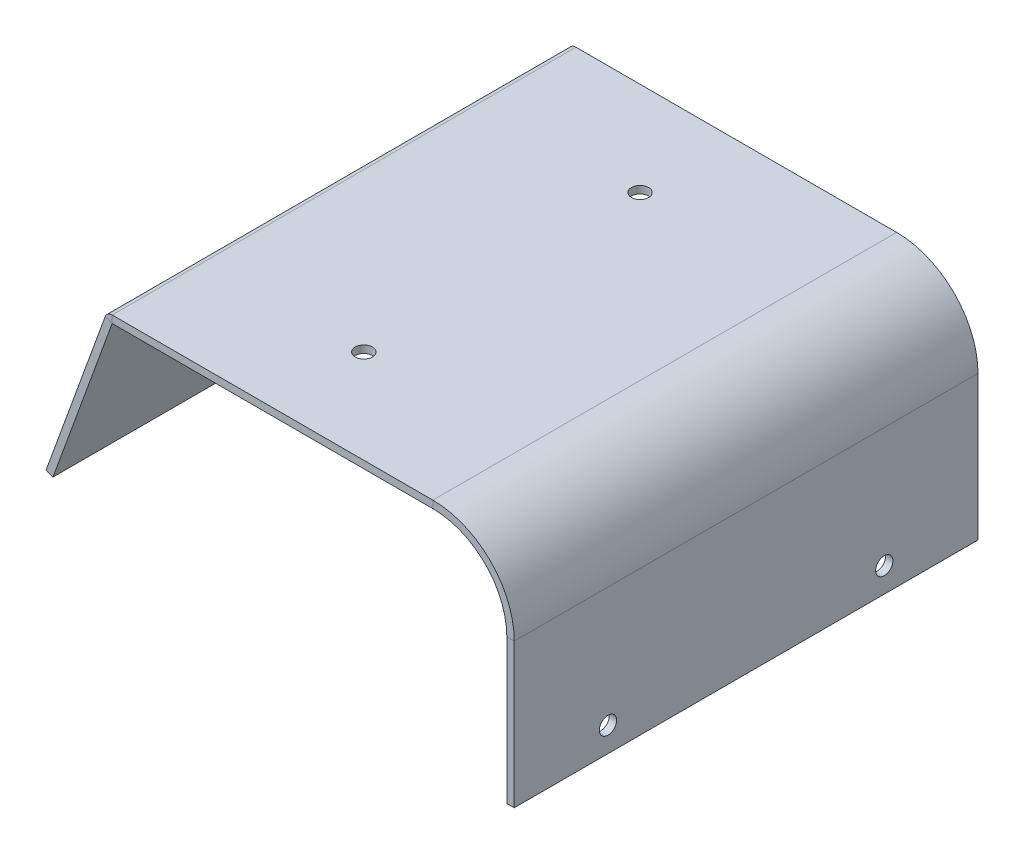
ISO-10303-21;
HEADER;
FILE_DESCRIPTION(('STEP AP214'),'2;1');
FILE_NAME('part.step','',(''),(''),'','','');
FILE_SCHEMA(('AUTOMOTIVE_DESIGN { 1 0 10303 214 1 1 1 1 }'));
ENDSEC;
DATA;
#1=APPLICATION_CONTEXT('core data for automotive mechanical design processes');
#2=APPLICATION_PROTOCOL_DEFINITION('international standard','automotive_design',2000,#1);
#3=PRODUCT_CONTEXT('',#1,'mechanical');
#4=PRODUCT('Part','Part','',(#3));
#5=PRODUCT_RELATED_PRODUCT_CATEGORY('part','',(#4));
#6=PRODUCT_DEFINITION_FORMATION('','',#4);
#7=PRODUCT_DEFINITION_CONTEXT('part definition',#1,'design');
#8=PRODUCT_DEFINITION('design','',#6,#7);
#9=PRODUCT_DEFINITION_SHAPE('','',#8);
#10=(LENGTH_UNIT() NAMED_UNIT(*) SI_UNIT(.MILLI.,.METRE.));
#11=(NAMED_UNIT(*) PLANE_ANGLE_UNIT() SI_UNIT($,.RADIAN.));
#12=(NAMED_UNIT(*) SI_UNIT($,.STERADIAN.) SOLID_ANGLE_UNIT());
#13=UNCERTAINTY_MEASURE_WITH_UNIT(LENGTH_MEASURE(1.E-05),#10,'distance_accuracy_value','');
#14=(GEOMETRIC_REPRESENTATION_CONTEXT(3) GLOBAL_UNCERTAINTY_ASSIGNED_CONTEXT((#13)) GLOBAL_UNIT_ASSIGNED_CONTEXT((#10,
#11,#12)) REPRESENTATION_CONTEXT('',''));
#15=CARTESIAN_POINT('',(0.,0.,0.));
#16=DIRECTION('',(0.,0.,1.));
#17=DIRECTION('',(1.,0.,0.));
#18=AXIS2_PLACEMENT_3D('',#15,#16,#17);
#19=CARTESIAN_POINT('',(0.,-1.5,0.));
#20=DIRECTION('',(0.,0.,1.));
#21=DIRECTION('',(1.,0.,0.));
#22=AXIS2_PLACEMENT_3D('',#19,#20,#21);
#23=PLANE('',#22);
#24=DIRECTION('',(1.,0.,0.));
#25=VECTOR('',#24,1.);
#26=CARTESIAN_POINT('',(0.,-1.5,0.));
#27=LINE('',#26,#25);
#28=CARTESIAN_POINT('',(36.,-1.5,0.));
#29=VERTEX_POINT('',#28);
#30=CARTESIAN_POINT('',(101.,-1.5,0.));
#31=VERTEX_POINT('',#30);
#32=EDGE_CURVE('E231',#29,#31,#27,.T.);
#33=ORIENTED_EDGE('',*,*,#32,.T.);
#34=DIRECTION('',(0.,1.,0.));
#35=VECTOR('',#34,1.);
#36=CARTESIAN_POINT('',(101.,-1.5,0.));
#37=LINE('',#36,#35);
#38=CARTESIAN_POINT('',(101.,0.,0.));
#39=VERTEX_POINT('',#38);
#40=EDGE_CURVE('E12',#31,#39,#37,.T.);
#41=ORIENTED_EDGE('',*,*,#40,.T.);
#42=DIRECTION('',(1.,0.,0.));
#43=VECTOR('',#42,1.);
#44=CARTESIAN_POINT('',(0.,0.,0.));
#45=LINE('',#44,#43);
#46=CARTESIAN_POINT('',(36.,0.,0.));
#47=VERTEX_POINT('',#46);
#48=EDGE_CURVE('E201',#47,#39,#45,.T.);
#49=ORIENTED_EDGE('',*,*,#48,.F.);
#50=DIRECTION('',(0.,1.,0.));
#51=VECTOR('',#50,1.);
#52=CARTESIAN_POINT('',(36.,-1.5,0.));
#53=LINE('',#52,#51);
#54=EDGE_CURVE('E218',#29,#47,#53,.T.);
#55=ORIENTED_EDGE('',*,*,#54,.F.);
#56=EDGE_LOOP('',(#33,#41,#49,#55));
#57=FACE_BOUND('',#56,.T.);
#58=ADVANCED_FACE('F43',(#57),#23,.T.);
#59=CARTESIAN_POINT('',(0.,-1.5,-94.));
#60=DIRECTION('',(0.,0.,-1.));
#61=DIRECTION('',(-1.,0.,0.));
#62=AXIS2_PLACEMENT_3D('',#59,#60,#61);
#63=PLANE('',#62);
#64=DIRECTION('',(-1.,0.,0.));
#65=VECTOR('',#64,1.);
#66=CARTESIAN_POINT('',(0.,0.,-94.));
#67=LINE('',#66,#65);
#68=CARTESIAN_POINT('',(101.,0.,-94.));
#69=VERTEX_POINT('',#68);
#70=CARTESIAN_POINT('',(36.,0.,-94.));
#71=VERTEX_POINT('',#70);
#72=EDGE_CURVE('E202',#69,#71,#67,.T.);
#73=ORIENTED_EDGE('',*,*,#72,.F.);
#74=DIRECTION('',(0.,-1.,0.));
#75=VECTOR('',#74,1.);
#76=CARTESIAN_POINT('',(101.,-1.5,-94.));
#77=LINE('',#76,#75);
#78=CARTESIAN_POINT('',(101.,-1.49999999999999,-94.));
#79=VERTEX_POINT('',#78);
#80=EDGE_CURVE('E258',#69,#79,#77,.T.);
#81=ORIENTED_EDGE('',*,*,#80,.T.);
#82=DIRECTION('',(-1.,0.,0.));
#83=VECTOR('',#82,1.);
#84=CARTESIAN_POINT('',(0.,-1.5,-94.));
#85=LINE('',#84,#83);
#86=CARTESIAN_POINT('',(36.,-1.5,-94.));
#87=VERTEX_POINT('',#86);
#88=EDGE_CURVE('E46',#79,#87,#85,.T.);
#89=ORIENTED_EDGE('',*,*,#88,.T.);
#90=DIRECTION('',(0.,-1.,0.));
#91=VECTOR('',#90,1.);
#92=CARTESIAN_POINT('',(36.,-1.5,-94.));
#93=LINE('',#92,#91);
#94=EDGE_CURVE('E215',#71,#87,#93,.T.);
#95=ORIENTED_EDGE('',*,*,#94,.F.);
#96=EDGE_LOOP('',(#73,#81,#89,#95));
#97=FACE_BOUND('',#96,.T.);
#98=ADVANCED_FACE('F271',(#97),#63,.T.);
#99=CARTESIAN_POINT('',(0.,-1.5,-94.));
#100=DIRECTION('',(0.,-1.,0.));
#101=DIRECTION('',(0.,0.,-1.));
#102=AXIS2_PLACEMENT_3D('',#99,#100,#101);
#103=PLANE('',#102);
#104=CARTESIAN_POINT('',(68.,-1.5,-75.));
#105=DIRECTION('',(0.,1.,0.));
#106=DIRECTION('',(0.,0.,1.));
#107=AXIS2_PLACEMENT_3D('',#104,#105,#106);
#108=CIRCLE('',#107,1.75);
#109=CARTESIAN_POINT('',(68.,-1.5,-73.25));
#110=VERTEX_POINT('',#109);
#111=EDGE_CURVE('E203',#110,#110,#108,.T.);
#112=ORIENTED_EDGE('',*,*,#111,.T.);
#113=EDGE_LOOP('',(#112));
#114=FACE_BOUND('',#113,.T.);
#115=CARTESIAN_POINT('',(68.,-1.5,-19.));
#116=DIRECTION('',(0.,1.,0.));
#117=DIRECTION('',(0.,0.,1.));
#118=AXIS2_PLACEMENT_3D('',#115,#116,#117);
#119=CIRCLE('',#118,1.75);
#120=CARTESIAN_POINT('',(68.,-1.5,-17.25));
#121=VERTEX_POINT('',#120);
#122=EDGE_CURVE('E206',#121,#121,#119,.T.);
#123=ORIENTED_EDGE('',*,*,#122,.T.);
#124=EDGE_LOOP('',(#123));
#125=FACE_BOUND('',#124,.T.);
#126=ORIENTED_EDGE('',*,*,#88,.F.);
#127=DIRECTION('',(0.,0.,1.));
#128=VECTOR('',#127,1.);
#129=CARTESIAN_POINT('',(101.,-1.5,-94.));
#130=LINE('',#129,#128);
#131=EDGE_CURVE('E249',#79,#31,#130,.T.);
#132=ORIENTED_EDGE('',*,*,#131,.T.);
#133=ORIENTED_EDGE('',*,*,#32,.F.);
#134=DIRECTION('',(0.,0.,1.));
#135=VECTOR('',#134,1.);
#136=CARTESIAN_POINT('',(36.,-1.5,-94.));
#137=LINE('',#136,#135);
#138=EDGE_CURVE('E193',#87,#29,#137,.T.);
#139=ORIENTED_EDGE('',*,*,#138,.F.);
#140=EDGE_LOOP('',(#126,#132,#133,#139));
#141=FACE_BOUND('',#140,.T.);
#142=ADVANCED_FACE('F274',(#114,#125,#141),#103,.T.);
#143=CARTESIAN_POINT('',(24.0001453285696,-34.4674059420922,-94.));
#144=DIRECTION('',(0.,0.,-1.));
#145=DIRECTION('',(-0.342020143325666,-0.93969262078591,0.));
#146=AXIS2_PLACEMENT_3D('',#143,#144,#145);
#147=PLANE('',#146);
#148=DIRECTION('',(-0.342020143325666,-0.93969262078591,0.));
#149=VECTOR('',#148,1.);
#150=CARTESIAN_POINT('',(22.5906063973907,-33.9543757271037,-94.));
#151=LINE('',#150,#149);
#152=CARTESIAN_POINT('',(34.5895213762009,-0.987627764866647,-94.));
#153=VERTEX_POINT('',#152);
#154=CARTESIAN_POINT('',(22.5906063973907,-33.9543757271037,-94.));
#155=VERTEX_POINT('',#154);
#156=EDGE_CURVE('E226',#153,#155,#151,.T.);
#157=ORIENTED_EDGE('',*,*,#156,.F.);
#158=DIRECTION('',(0.93969262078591,-0.342020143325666,0.));
#159=VECTOR('',#158,1.);
#160=CARTESIAN_POINT('',(35.9990603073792,-1.50065797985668,-94.));
#161=LINE('',#160,#159);
#162=CARTESIAN_POINT('',(35.9990603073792,-1.50065797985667,-94.));
#163=VERTEX_POINT('',#162);
#164=EDGE_CURVE('E241',#153,#163,#161,.T.);
#165=ORIENTED_EDGE('',*,*,#164,.T.);
#166=DIRECTION('',(-0.342020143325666,-0.93969262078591,0.));
#167=VECTOR('',#166,1.);
#168=CARTESIAN_POINT('',(24.0001453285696,-34.4674059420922,-94.));
#169=LINE('',#168,#167);
#170=CARTESIAN_POINT('',(24.0001453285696,-34.4674059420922,-94.));
#171=VERTEX_POINT('',#170);
#172=EDGE_CURVE('E238',#163,#171,#169,.T.);
#173=ORIENTED_EDGE('',*,*,#172,.T.);
#174=DIRECTION('',(-0.93969262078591,0.342020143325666,0.));
#175=VECTOR('',#174,1.);
#176=CARTESIAN_POINT('',(24.0001453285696,-34.4674059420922,-94.));
#177=LINE('',#176,#175);
#178=EDGE_CURVE('E232',#171,#155,#177,.T.);
#179=ORIENTED_EDGE('',*,*,#178,.T.);
#180=EDGE_LOOP('',(#157,#165,#173,#179));
#181=FACE_BOUND('',#180,.T.);
#182=ADVANCED_FACE('F295',(#181),#147,.T.);
#183=CARTESIAN_POINT('',(24.0001453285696,-34.4674059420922,0.));
#184=DIRECTION('',(0.,0.,1.));
#185=DIRECTION('',(0.342020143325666,0.93969262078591,0.));
#186=AXIS2_PLACEMENT_3D('',#183,#184,#185);
#187=PLANE('',#186);
#188=DIRECTION('',(0.342020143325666,0.93969262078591,0.));
#189=VECTOR('',#188,1.);
#190=CARTESIAN_POINT('',(24.0001453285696,-34.4674059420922,0.));
#191=LINE('',#190,#189);
#192=CARTESIAN_POINT('',(24.0001453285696,-34.4674059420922,0.));
#193=VERTEX_POINT('',#192);
#194=CARTESIAN_POINT('',(35.9990603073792,-1.50065797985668,0.));
#195=VERTEX_POINT('',#194);
#196=EDGE_CURVE('E225',#193,#195,#191,.T.);
#197=ORIENTED_EDGE('',*,*,#196,.T.);
#198=DIRECTION('',(-0.93969262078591,0.342020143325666,0.));
#199=VECTOR('',#198,1.);
#200=CARTESIAN_POINT('',(35.9990603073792,-1.50065797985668,0.));
#201=LINE('',#200,#199);
#202=CARTESIAN_POINT('',(34.5895213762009,-0.987627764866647,0.));
#203=VERTEX_POINT('',#202);
#204=EDGE_CURVE('E246',#195,#203,#201,.T.);
#205=ORIENTED_EDGE('',*,*,#204,.T.);
#206=DIRECTION('',(0.342020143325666,0.93969262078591,0.));
#207=VECTOR('',#206,1.);
#208=CARTESIAN_POINT('',(22.5906063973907,-33.9543757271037,0.));
#209=LINE('',#208,#207);
#210=CARTESIAN_POINT('',(22.5906063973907,-33.9543757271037,0.));
#211=VERTEX_POINT('',#210);
#212=EDGE_CURVE('E230',#211,#203,#209,.T.);
#213=ORIENTED_EDGE('',*,*,#212,.F.);
#214=DIRECTION('',(-0.93969262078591,0.342020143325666,0.));
#215=VECTOR('',#214,1.);
#216=CARTESIAN_POINT('',(24.0001453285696,-34.4674059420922,0.));
#217=LINE('',#216,#215);
#218=EDGE_CURVE('E236',#193,#211,#217,.T.);
#219=ORIENTED_EDGE('',*,*,#218,.F.);
#220=EDGE_LOOP('',(#197,#205,#213,#219));
#221=FACE_BOUND('',#220,.T.);
#222=ADVANCED_FACE('F287',(#221),#187,.T.);
#223=CARTESIAN_POINT('',(24.0001453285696,-34.4674059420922,-94.));
#224=DIRECTION('',(0.93969262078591,-0.342020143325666,0.));
#225=DIRECTION('',(0.,0.,-1.));
#226=AXIS2_PLACEMENT_3D('',#223,#224,#225);
#227=PLANE('',#226);
#228=ORIENTED_EDGE('',*,*,#172,.F.);
#229=DIRECTION('',(0.,0.,1.));
#230=VECTOR('',#229,1.);
#231=CARTESIAN_POINT('',(35.9990603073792,-1.50065797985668,-94.));
#232=LINE('',#231,#230);
#233=EDGE_CURVE('E235',#163,#195,#232,.T.);
#234=ORIENTED_EDGE('',*,*,#233,.T.);
#235=ORIENTED_EDGE('',*,*,#196,.F.);
#236=DIRECTION('',(0.,0.,1.));
#237=VECTOR('',#236,1.);
#238=CARTESIAN_POINT('',(24.0001453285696,-34.4674059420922,0.));
#239=LINE('',#238,#237);
#240=EDGE_CURVE('E222',#171,#193,#239,.T.);
#241=ORIENTED_EDGE('',*,*,#240,.F.);
#242=EDGE_LOOP('',(#228,#234,#235,#241));
#243=FACE_BOUND('',#242,.T.);
#244=ADVANCED_FACE('F284',(#243),#227,.T.);
#245=CARTESIAN_POINT('',(24.0001453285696,-34.4674059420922,0.));
#246=DIRECTION('',(-0.342020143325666,-0.93969262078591,0.));
#247=DIRECTION('',(0.,0.,1.));
#248=AXIS2_PLACEMENT_3D('',#245,#246,#247);
#249=PLANE('',#248);
#250=DIRECTION('',(0.,0.,1.));
#251=VECTOR('',#250,1.);
#252=CARTESIAN_POINT('',(22.5906063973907,-33.9543757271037,0.));
#253=LINE('',#252,#251);
#254=EDGE_CURVE('E227',#155,#211,#253,.T.);
#255=ORIENTED_EDGE('',*,*,#254,.F.);
#256=ORIENTED_EDGE('',*,*,#178,.F.);
#257=ORIENTED_EDGE('',*,*,#240,.T.);
#258=ORIENTED_EDGE('',*,*,#218,.T.);
#259=EDGE_LOOP('',(#255,#256,#257,#258));
#260=FACE_BOUND('',#259,.T.);
#261=ADVANCED_FACE('F291',(#260),#249,.T.);
#262=CARTESIAN_POINT('',(22.5906063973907,-33.9543757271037,-94.));
#263=DIRECTION('',(0.93969262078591,-0.342020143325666,0.));
#264=DIRECTION('',(0.,0.,-1.));
#265=AXIS2_PLACEMENT_3D('',#262,#263,#264);
#266=PLANE('',#265);
#267=DIRECTION('',(0.,0.,1.));
#268=VECTOR('',#267,1.);
#269=CARTESIAN_POINT('',(34.5895213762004,-0.987627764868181,-94.));
#270=LINE('',#269,#268);
#271=EDGE_CURVE('E244',#153,#203,#270,.T.);
#272=ORIENTED_EDGE('',*,*,#271,.F.);
#273=ORIENTED_EDGE('',*,*,#156,.T.);
#274=ORIENTED_EDGE('',*,*,#254,.T.);
#275=ORIENTED_EDGE('',*,*,#212,.T.);
#276=EDGE_LOOP('',(#272,#273,#274,#275));
#277=FACE_BOUND('',#276,.T.);
#278=ADVANCED_FACE('F378',(#277),#266,.F.);
#279=CARTESIAN_POINT('',(68.,-1.5,-75.));
#280=DIRECTION('',(0.,1.,0.));
#281=DIRECTION('',(0.,0.,1.));
#282=AXIS2_PLACEMENT_3D('',#279,#280,#281);
#283=CYLINDRICAL_SURFACE('',#282,1.75);
#284=ORIENTED_EDGE('',*,*,#111,.F.);
#285=EDGE_LOOP('',(#284));
#286=FACE_BOUND('',#285,.T.);
#287=CARTESIAN_POINT('',(68.,0.,-75.));
#288=DIRECTION('',(0.,1.,0.));
#289=DIRECTION('',(0.,0.,1.));
#290=AXIS2_PLACEMENT_3D('',#287,#288,#289);
#291=CIRCLE('',#290,1.75);
#292=CARTESIAN_POINT('',(68.,0.,-73.25));
#293=VERTEX_POINT('',#292);
#294=EDGE_CURVE('E212',#293,#293,#291,.T.);
#295=ORIENTED_EDGE('',*,*,#294,.T.);
#296=EDGE_LOOP('',(#295));
#297=FACE_BOUND('',#296,.T.);
#298=ADVANCED_FACE('F372',(#286,#297),#283,.F.);
#299=CARTESIAN_POINT('',(68.,-1.5,-19.));
#300=DIRECTION('',(0.,1.,0.));
#301=DIRECTION('',(0.,0.,1.));
#302=AXIS2_PLACEMENT_3D('',#299,#300,#301);
#303=CYLINDRICAL_SURFACE('',#302,1.75);
#304=ORIENTED_EDGE('',*,*,#122,.F.);
#305=EDGE_LOOP('',(#304));
#306=FACE_BOUND('',#305,.T.);
#307=CARTESIAN_POINT('',(68.,0.,-19.));
#308=DIRECTION('',(0.,1.,0.));
#309=DIRECTION('',(0.,0.,1.));
#310=AXIS2_PLACEMENT_3D('',#307,#308,#309);
#311=CIRCLE('',#310,1.75);
#312=CARTESIAN_POINT('',(68.,0.,-17.25));
#313=VERTEX_POINT('',#312);
#314=EDGE_CURVE('E209',#313,#313,#311,.T.);
#315=ORIENTED_EDGE('',*,*,#314,.T.);
#316=EDGE_LOOP('',(#315));
#317=FACE_BOUND('',#316,.T.);
#318=ADVANCED_FACE('F366',(#306,#317),#303,.F.);
#319=CARTESIAN_POINT('',(0.,0.,-94.));
#320=DIRECTION('',(0.,-1.,0.));
#321=DIRECTION('',(0.,0.,-1.));
#322=AXIS2_PLACEMENT_3D('',#319,#320,#321);
#323=PLANE('',#322);
#324=DIRECTION('',(0.,0.,1.));
#325=VECTOR('',#324,1.);
#326=CARTESIAN_POINT('',(101.,0.,-94.));
#327=LINE('',#326,#325);
#328=EDGE_CURVE('E51',#69,#39,#327,.T.);
#329=ORIENTED_EDGE('',*,*,#328,.F.);
#330=ORIENTED_EDGE('',*,*,#72,.T.);
#331=DIRECTION('',(0.,0.,1.));
#332=VECTOR('',#331,1.);
#333=CARTESIAN_POINT('',(36.,0.,-94.));
#334=LINE('',#333,#332);
#335=EDGE_CURVE('E198',#71,#47,#334,.T.);
#336=ORIENTED_EDGE('',*,*,#335,.T.);
#337=ORIENTED_EDGE('',*,*,#48,.T.);
#338=EDGE_LOOP('',(#329,#330,#336,#337));
#339=FACE_BOUND('',#338,.T.);
#340=ORIENTED_EDGE('',*,*,#294,.F.);
#341=EDGE_LOOP('',(#340));
#342=FACE_BOUND('',#341,.T.);
#343=ORIENTED_EDGE('',*,*,#314,.F.);
#344=EDGE_LOOP('',(#343));
#345=FACE_BOUND('',#344,.T.);
#346=ADVANCED_FACE('F300',(#339,#342,#345),#323,.F.);
#347=CARTESIAN_POINT('',(36.,-1.501,-94.));
#348=DIRECTION('',(0.,0.,1.));
#349=DIRECTION('',(1.,0.,0.));
#350=AXIS2_PLACEMENT_3D('',#347,#348,#349);
#351=PLANE('',#350);
#352=ORIENTED_EDGE('',*,*,#164,.F.);
#353=CARTESIAN_POINT('',(36.,-1.501,-94.));
#354=DIRECTION('',(0.,0.,-1.));
#355=DIRECTION('',(-1.,0.,0.));
#356=AXIS2_PLACEMENT_3D('',#353,#354,#355);
#357=CIRCLE('',#356,1.501);
#358=EDGE_CURVE('E184',#153,#71,#357,.T.);
#359=ORIENTED_EDGE('',*,*,#358,.T.);
#360=ORIENTED_EDGE('',*,*,#94,.T.);
#361=CARTESIAN_POINT('',(36.,-1.501,-94.));
#362=DIRECTION('',(0.,0.,-1.));
#363=DIRECTION('',(1.,0.,0.));
#364=AXIS2_PLACEMENT_3D('',#361,#362,#363);
#365=CIRCLE('',#364,0.00100000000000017);
#366=EDGE_CURVE('E188',#163,#87,#365,.T.);
#367=ORIENTED_EDGE('',*,*,#366,.F.);
#368=EDGE_LOOP('',(#352,#359,#360,#367));
#369=FACE_BOUND('',#368,.T.);
#370=ADVANCED_FACE('F278',(#369),#351,.F.);
#371=CARTESIAN_POINT('',(36.,-1.501,0.));
#372=DIRECTION('',(0.,0.,-1.));
#373=DIRECTION('',(-1.,0.,0.));
#374=AXIS2_PLACEMENT_3D('',#371,#372,#373);
#375=PLANE('',#374);
#376=CARTESIAN_POINT('',(36.,-1.501,0.));
#377=DIRECTION('',(0.,0.,-1.));
#378=DIRECTION('',(-1.,0.,0.));
#379=AXIS2_PLACEMENT_3D('',#376,#377,#378);
#380=CIRCLE('',#379,1.501);
#381=EDGE_CURVE('E191',#47,#203,#380,.F.);
#382=ORIENTED_EDGE('',*,*,#381,.T.);
#383=ORIENTED_EDGE('',*,*,#204,.F.);
#384=CARTESIAN_POINT('',(36.,-1.501,0.));
#385=DIRECTION('',(0.,0.,1.));
#386=DIRECTION('',(-1.,0.,0.));
#387=AXIS2_PLACEMENT_3D('',#384,#385,#386);
#388=CIRCLE('',#387,0.00100000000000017);
#389=EDGE_CURVE('E66',#29,#195,#388,.T.);
#390=ORIENTED_EDGE('',*,*,#389,.F.);
#391=ORIENTED_EDGE('',*,*,#54,.T.);
#392=EDGE_LOOP('',(#382,#383,#390,#391));
#393=FACE_BOUND('',#392,.T.);
#394=ADVANCED_FACE('F303',(#393),#375,.F.);
#395=CARTESIAN_POINT('',(36.,-1.501,47.0164445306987));
#396=DIRECTION('',(0.,0.,-1.));
#397=DIRECTION('',(-1.,0.,0.));
#398=AXIS2_PLACEMENT_3D('',#395,#396,#397);
#399=CYLINDRICAL_SURFACE('',#398,0.001);
#400=ORIENTED_EDGE('',*,*,#138,.T.);
#401=ORIENTED_EDGE('',*,*,#389,.T.);
#402=ORIENTED_EDGE('',*,*,#233,.F.);
#403=ORIENTED_EDGE('',*,*,#366,.T.);
#404=EDGE_LOOP('',(#400,#401,#402,#403));
#405=FACE_BOUND('',#404,.T.);
#406=ADVANCED_FACE('F281',(#405),#399,.F.);
#407=CARTESIAN_POINT('',(36.,-1.501,47.0164445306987));
#408=DIRECTION('',(0.,0.,-1.));
#409=DIRECTION('',(-1.,0.,0.));
#410=AXIS2_PLACEMENT_3D('',#407,#408,#409);
#411=CYLINDRICAL_SURFACE('',#410,1.501);
#412=ORIENTED_EDGE('',*,*,#335,.F.);
#413=ORIENTED_EDGE('',*,*,#358,.F.);
#414=ORIENTED_EDGE('',*,*,#271,.T.);
#415=ORIENTED_EDGE('',*,*,#381,.F.);
#416=EDGE_LOOP('',(#412,#413,#414,#415));
#417=FACE_BOUND('',#416,.T.);
#418=ADVANCED_FACE('F298',(#417),#411,.T.);
#419=CARTESIAN_POINT('',(101.,-16.5,-94.));
#420=DIRECTION('',(0.,0.,1.));
#421=DIRECTION('',(1.,0.,0.));
#422=AXIS2_PLACEMENT_3D('',#419,#420,#421);
#423=PLANE('',#422);
#424=ORIENTED_EDGE('',*,*,#80,.F.);
#425=CARTESIAN_POINT('',(101.,-16.5,-94.));
#426=DIRECTION('',(0.,0.,1.));
#427=DIRECTION('',(1.,0.,0.));
#428=AXIS2_PLACEMENT_3D('',#425,#426,#427);
#429=CIRCLE('',#428,16.5);
#430=CARTESIAN_POINT('',(117.5,-16.5,-94.));
#431=VERTEX_POINT('',#430);
#432=EDGE_CURVE('E153',#69,#431,#429,.F.);
#433=ORIENTED_EDGE('',*,*,#432,.T.);
#434=DIRECTION('',(-1.,0.,0.));
#435=VECTOR('',#434,1.);
#436=CARTESIAN_POINT('',(116.,-16.5,-94.));
#437=LINE('',#436,#435);
#438=CARTESIAN_POINT('',(116.,-16.5,-94.));
#439=VERTEX_POINT('',#438);
#440=EDGE_CURVE('E171',#431,#439,#437,.T.);
#441=ORIENTED_EDGE('',*,*,#440,.T.);
#442=CARTESIAN_POINT('',(101.,-16.5,-94.));
#443=DIRECTION('',(0.,0.,-1.));
#444=DIRECTION('',(1.,0.,0.));
#445=AXIS2_PLACEMENT_3D('',#442,#443,#444);
#446=CIRCLE('',#445,15.);
#447=EDGE_CURVE('E177',#79,#439,#446,.T.);
#448=ORIENTED_EDGE('',*,*,#447,.F.);
#449=EDGE_LOOP('',(#424,#433,#441,#448));
#450=FACE_BOUND('',#449,.T.);
#451=ADVANCED_FACE('F320',(#450),#423,.F.);
#452=CARTESIAN_POINT('',(101.,-16.5,0.));
#453=DIRECTION('',(0.,0.,-1.));
#454=DIRECTION('',(-1.,0.,0.));
#455=AXIS2_PLACEMENT_3D('',#452,#453,#454);
#456=PLANE('',#455);
#457=DIRECTION('',(1.,0.,0.));
#458=VECTOR('',#457,1.);
#459=CARTESIAN_POINT('',(116.,-16.5000000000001,0.));
#460=LINE('',#459,#458);
#461=CARTESIAN_POINT('',(116.,-16.5000000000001,0.));
#462=VERTEX_POINT('',#461);
#463=CARTESIAN_POINT('',(117.5,-16.5000000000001,0.));
#464=VERTEX_POINT('',#463);
#465=EDGE_CURVE('E141',#462,#464,#460,.T.);
#466=ORIENTED_EDGE('',*,*,#465,.T.);
#467=CARTESIAN_POINT('',(101.,-16.5,0.));
#468=DIRECTION('',(0.,0.,1.));
#469=DIRECTION('',(1.,0.,0.));
#470=AXIS2_PLACEMENT_3D('',#467,#468,#469);
#471=CIRCLE('',#470,16.5);
#472=EDGE_CURVE('E181',#464,#39,#471,.T.);
#473=ORIENTED_EDGE('',*,*,#472,.T.);
#474=ORIENTED_EDGE('',*,*,#40,.F.);
#475=CARTESIAN_POINT('',(101.,-16.5,0.));
#476=DIRECTION('',(0.,0.,1.));
#477=DIRECTION('',(-1.,0.,0.));
#478=AXIS2_PLACEMENT_3D('',#475,#476,#477);
#479=CIRCLE('',#478,15.);
#480=EDGE_CURVE('E180',#462,#31,#479,.T.);
#481=ORIENTED_EDGE('',*,*,#480,.F.);
#482=EDGE_LOOP('',(#466,#473,#474,#481));
#483=FACE_BOUND('',#482,.T.);
#484=ADVANCED_FACE('F307',(#483),#456,.F.);
#485=CARTESIAN_POINT('',(101.,-16.5,-144.21275474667));
#486=DIRECTION('',(0.,0.,1.));
#487=DIRECTION('',(1.,0.,0.));
#488=AXIS2_PLACEMENT_3D('',#485,#486,#487);
#489=CYLINDRICAL_SURFACE('',#488,15.);
#490=ORIENTED_EDGE('',*,*,#480,.T.);
#491=ORIENTED_EDGE('',*,*,#131,.F.);
#492=ORIENTED_EDGE('',*,*,#447,.T.);
#493=DIRECTION('',(0.,0.,1.));
#494=VECTOR('',#493,1.);
#495=CARTESIAN_POINT('',(116.,-16.5000000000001,-94.));
#496=LINE('',#495,#494);
#497=EDGE_CURVE('E175',#439,#462,#496,.T.);
#498=ORIENTED_EDGE('',*,*,#497,.T.);
#499=EDGE_LOOP('',(#490,#491,#492,#498));
#500=FACE_BOUND('',#499,.T.);
#501=ADVANCED_FACE('F310',(#500),#489,.F.);
#502=CARTESIAN_POINT('',(101.,-16.5,-144.21275474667));
#503=DIRECTION('',(0.,0.,1.));
#504=DIRECTION('',(1.,0.,0.));
#505=AXIS2_PLACEMENT_3D('',#502,#503,#504);
#506=CYLINDRICAL_SURFACE('',#505,16.5);
#507=ORIENTED_EDGE('',*,*,#472,.F.);
#508=DIRECTION('',(0.,0.,1.));
#509=VECTOR('',#508,1.);
#510=CARTESIAN_POINT('',(117.5,-16.5000000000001,-94.));
#511=LINE('',#510,#509);
#512=EDGE_CURVE('E323',#431,#464,#511,.T.);
#513=ORIENTED_EDGE('',*,*,#512,.F.);
#514=ORIENTED_EDGE('',*,*,#432,.F.);
#515=ORIENTED_EDGE('',*,*,#328,.T.);
#516=EDGE_LOOP('',(#507,#513,#514,#515));
#517=FACE_BOUND('',#516,.T.);
#518=ADVANCED_FACE('F321',(#517),#506,.T.);
#519=CARTESIAN_POINT('',(116.,-40.7599578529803,-75.));
#520=DIRECTION('',(1.,0.,0.));
#521=DIRECTION('',(0.,0.,1.));
#522=AXIS2_PLACEMENT_3D('',#519,#520,#521);
#523=CYLINDRICAL_SURFACE('',#522,1.75000000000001);
#524=CARTESIAN_POINT('',(116.,-40.7599578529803,-75.));
#525=DIRECTION('',(1.,0.,0.));
#526=DIRECTION('',(0.,0.,1.));
#527=AXIS2_PLACEMENT_3D('',#524,#525,#526);
#528=CIRCLE('',#527,1.75000000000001);
#529=CARTESIAN_POINT('',(116.,-40.7599578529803,-73.25));
#530=VERTEX_POINT('',#529);
#531=EDGE_CURVE('E317',#530,#530,#528,.T.);
#532=ORIENTED_EDGE('',*,*,#531,.F.);
#533=EDGE_LOOP('',(#532));
#534=FACE_BOUND('',#533,.T.);
#535=CARTESIAN_POINT('',(117.5,-40.7599578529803,-75.));
#536=DIRECTION('',(1.,0.,0.));
#537=DIRECTION('',(0.,0.,1.));
#538=AXIS2_PLACEMENT_3D('',#535,#536,#537);
#539=CIRCLE('',#538,1.75000000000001);
#540=CARTESIAN_POINT('',(117.5,-40.7599578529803,-73.25));
#541=VERTEX_POINT('',#540);
#542=EDGE_CURVE('E165',#541,#541,#539,.T.);
#543=ORIENTED_EDGE('',*,*,#542,.T.);
#544=EDGE_LOOP('',(#543));
#545=FACE_BOUND('',#544,.T.);
#546=ADVANCED_FACE('F339',(#534,#545),#523,.F.);
#547=CARTESIAN_POINT('',(116.,-40.7599578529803,-19.));
#548=DIRECTION('',(1.,0.,0.));
#549=DIRECTION('',(0.,0.,1.));
#550=AXIS2_PLACEMENT_3D('',#547,#548,#549);
#551=CYLINDRICAL_SURFACE('',#550,1.75000000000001);
#552=CARTESIAN_POINT('',(116.,-40.7599578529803,-19.));
#553=DIRECTION('',(1.,0.,0.));
#554=DIRECTION('',(0.,0.,1.));
#555=AXIS2_PLACEMENT_3D('',#552,#553,#554);
#556=CIRCLE('',#555,1.75000000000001);
#557=CARTESIAN_POINT('',(116.,-40.7599578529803,-17.25));
#558=VERTEX_POINT('',#557);
#559=EDGE_CURVE('E162',#558,#558,#556,.T.);
#560=ORIENTED_EDGE('',*,*,#559,.F.);
#561=EDGE_LOOP('',(#560));
#562=FACE_BOUND('',#561,.T.);
#563=CARTESIAN_POINT('',(117.5,-40.7599578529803,-19.));
#564=DIRECTION('',(1.,0.,0.));
#565=DIRECTION('',(0.,0.,1.));
#566=AXIS2_PLACEMENT_3D('',#563,#564,#565);
#567=CIRCLE('',#566,1.75000000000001);
#568=CARTESIAN_POINT('',(117.5,-40.7599578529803,-17.25));
#569=VERTEX_POINT('',#568);
#570=EDGE_CURVE('E160',#569,#569,#567,.T.);
#571=ORIENTED_EDGE('',*,*,#570,.T.);
#572=EDGE_LOOP('',(#571));
#573=FACE_BOUND('',#572,.T.);
#574=ADVANCED_FACE('F336',(#562,#573),#551,.F.);
#575=CARTESIAN_POINT('',(116.,-45.7599578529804,0.));
#576=DIRECTION('',(0.,-1.,0.));
#577=DIRECTION('',(0.,0.,-1.));
#578=AXIS2_PLACEMENT_3D('',#575,#576,#577);
#579=PLANE('',#578);
#580=DIRECTION('',(0.,0.,-1.));
#581=VECTOR('',#580,1.);
#582=CARTESIAN_POINT('',(117.5,-45.7599578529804,0.));
#583=LINE('',#582,#581);
#584=CARTESIAN_POINT('',(117.5,-45.7599578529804,0.));
#585=VERTEX_POINT('',#584);
#586=CARTESIAN_POINT('',(117.5,-45.7599578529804,-94.));
#587=VERTEX_POINT('',#586);
#588=EDGE_CURVE('E145',#585,#587,#583,.T.);
#589=ORIENTED_EDGE('',*,*,#588,.F.);
#590=DIRECTION('',(1.,0.,0.));
#591=VECTOR('',#590,1.);
#592=CARTESIAN_POINT('',(116.,-45.7599578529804,0.));
#593=LINE('',#592,#591);
#594=CARTESIAN_POINT('',(116.,-45.7599578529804,0.));
#595=VERTEX_POINT('',#594);
#596=EDGE_CURVE('E138',#595,#585,#593,.T.);
#597=ORIENTED_EDGE('',*,*,#596,.F.);
#598=DIRECTION('',(0.,0.,-1.));
#599=VECTOR('',#598,1.);
#600=CARTESIAN_POINT('',(116.,-45.7599578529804,0.));
#601=LINE('',#600,#599);
#602=CARTESIAN_POINT('',(116.,-45.7599578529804,-94.));
#603=VERTEX_POINT('',#602);
#604=EDGE_CURVE('E150',#595,#603,#601,.T.);
#605=ORIENTED_EDGE('',*,*,#604,.T.);
#606=DIRECTION('',(1.,0.,0.));
#607=VECTOR('',#606,1.);
#608=CARTESIAN_POINT('',(116.,-45.7599578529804,-94.));
#609=LINE('',#608,#607);
#610=EDGE_CURVE('E159',#603,#587,#609,.T.);
#611=ORIENTED_EDGE('',*,*,#610,.T.);
#612=EDGE_LOOP('',(#589,#597,#605,#611));
#613=FACE_BOUND('',#612,.T.);
#614=ADVANCED_FACE('F149',(#613),#579,.T.);
#615=CARTESIAN_POINT('',(116.,109.24004214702,-94.));
#616=DIRECTION('',(-1.,0.,0.));
#617=DIRECTION('',(0.,0.,-1.));
#618=AXIS2_PLACEMENT_3D('',#615,#616,#617);
#619=PLANE('',#618);
#620=ORIENTED_EDGE('',*,*,#497,.F.);
#621=DIRECTION('',(0.,1.,0.));
#622=VECTOR('',#621,1.);
#623=CARTESIAN_POINT('',(116.,109.24004214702,-94.));
#624=LINE('',#623,#622);
#625=EDGE_CURVE('E158',#603,#439,#624,.T.);
#626=ORIENTED_EDGE('',*,*,#625,.F.);
#627=ORIENTED_EDGE('',*,*,#604,.F.);
#628=DIRECTION('',(0.,-1.,0.));
#629=VECTOR('',#628,1.);
#630=CARTESIAN_POINT('',(116.,109.24004214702,0.));
#631=LINE('',#630,#629);
#632=EDGE_CURVE('E135',#462,#595,#631,.T.);
#633=ORIENTED_EDGE('',*,*,#632,.F.);
#634=EDGE_LOOP('',(#620,#626,#627,#633));
#635=FACE_BOUND('',#634,.T.);
#636=ORIENTED_EDGE('',*,*,#559,.T.);
#637=EDGE_LOOP('',(#636));
#638=FACE_BOUND('',#637,.T.);
#639=ORIENTED_EDGE('',*,*,#531,.T.);
#640=EDGE_LOOP('',(#639));
#641=FACE_BOUND('',#640,.T.);
#642=ADVANCED_FACE('F155',(#635,#638,#641),#619,.T.);
#643=CARTESIAN_POINT('',(116.,109.24004214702,-94.));
#644=DIRECTION('',(0.,0.,-1.));
#645=DIRECTION('',(0.,1.,0.));
#646=AXIS2_PLACEMENT_3D('',#643,#644,#645);
#647=PLANE('',#646);
#648=ORIENTED_EDGE('',*,*,#440,.F.);
#649=DIRECTION('',(0.,1.,0.));
#650=VECTOR('',#649,1.);
#651=CARTESIAN_POINT('',(117.5,109.24004214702,-94.));
#652=LINE('',#651,#650);
#653=EDGE_CURVE('E316',#587,#431,#652,.T.);
#654=ORIENTED_EDGE('',*,*,#653,.F.);
#655=ORIENTED_EDGE('',*,*,#610,.F.);
#656=ORIENTED_EDGE('',*,*,#625,.T.);
#657=EDGE_LOOP('',(#648,#654,#655,#656));
#658=FACE_BOUND('',#657,.T.);
#659=ADVANCED_FACE('F313',(#658),#647,.T.);
#660=CARTESIAN_POINT('',(117.5,109.24004214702,-94.));
#661=DIRECTION('',(-1.,0.,0.));
#662=DIRECTION('',(0.,0.,-1.));
#663=AXIS2_PLACEMENT_3D('',#660,#661,#662);
#664=PLANE('',#663);
#665=ORIENTED_EDGE('',*,*,#542,.F.);
#666=EDGE_LOOP('',(#665));
#667=FACE_BOUND('',#666,.T.);
#668=ORIENTED_EDGE('',*,*,#570,.F.);
#669=EDGE_LOOP('',(#668));
#670=FACE_BOUND('',#669,.T.);
#671=ORIENTED_EDGE('',*,*,#653,.T.);
#672=ORIENTED_EDGE('',*,*,#512,.T.);
#673=DIRECTION('',(0.,-1.,0.));
#674=VECTOR('',#673,1.);
#675=CARTESIAN_POINT('',(117.5,109.24004214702,0.));
#676=LINE('',#675,#674);
#677=EDGE_CURVE('E325',#464,#585,#676,.T.);
#678=ORIENTED_EDGE('',*,*,#677,.T.);
#679=ORIENTED_EDGE('',*,*,#588,.T.);
#680=EDGE_LOOP('',(#671,#672,#678,#679));
#681=FACE_BOUND('',#680,.T.);
#682=ADVANCED_FACE('F343',(#667,#670,#681),#664,.F.);
#683=CARTESIAN_POINT('',(116.,109.24004214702,0.));
#684=DIRECTION('',(0.,0.,1.));
#685=DIRECTION('',(0.,-1.,0.));
#686=AXIS2_PLACEMENT_3D('',#683,#684,#685);
#687=PLANE('',#686);
#688=ORIENTED_EDGE('',*,*,#465,.F.);
#689=ORIENTED_EDGE('',*,*,#632,.T.);
#690=ORIENTED_EDGE('',*,*,#596,.T.);
#691=ORIENTED_EDGE('',*,*,#677,.F.);
#692=EDGE_LOOP('',(#688,#689,#690,#691));
#693=FACE_BOUND('',#692,.T.);
#694=ADVANCED_FACE('F137',(#693),#687,.T.);
#695=CLOSED_SHELL('',(#58,#98,#142,#182,#222,#244,#261,#278,#298,#318,#346,#370,#394,#406,#418,
#451,#484,#501,#518,#546,#574,#614,#642,#659,#682,#694));
#696=MANIFOLD_SOLID_BREP('B2',#695);
#697=ADVANCED_BREP_SHAPE_REPRESENTATION('',(#18,#696),#14);
#698=SHAPE_DEFINITION_REPRESENTATION(#9,#697);
ENDSEC;
END-ISO-10303-21;
